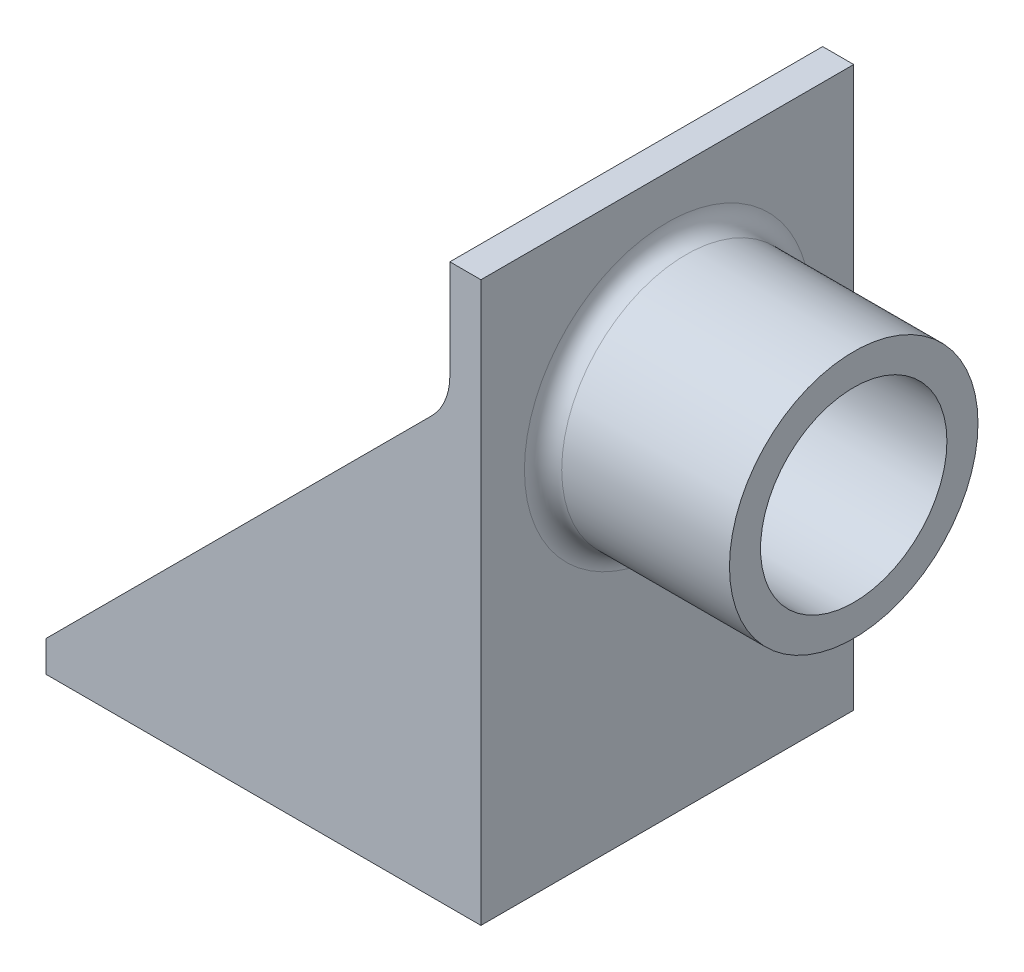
from build123d import *

# Parameters (mm, degrees)
EXTRUDE1_DEPTH = 30
FILLET1_R      = 10
EXTRUDE2_START = -5
EXTRUDE2_DEPTH = 5
FILLET2_R      = 10
SKETCH3_R      = 20
SKETCH3_R_2    = 15
EXTRUDE3_DEPTH = 30
FILLET3_R      = 3


with BuildPart() as part:
    # Sketch1 → Extrude1 (new, symmetric)
    with BuildSketch(Plane.XY):
        Polygon((0, 0), (70, 0), (70, 90), (65, 90), (65, 5), (0, 5), align=None)
    extrude(amount=EXTRUDE1_DEPTH, both=True)

    # Fillet1
    fillet1_edges = [part.edges().sort_by_distance(p)[0] for p in [
        (65, 5, 0),
    ]]
    fillet(fillet1_edges, radius=FILLET1_R)

    # Sketch2 → Extrude2 (add)
    with BuildSketch(Plane.XY.offset(30).offset(EXTRUDE2_START)):
        with BuildLine():
            Line((65, 70), (0, 5))
            Line((0, 5), (55, 5))
            ThreePointArc((55, 5), (62.071067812, 7.928932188), (65, 15))
            Line((65, 15), (65, 70))
        make_face()
    extrude2 = extrude(amount=EXTRUDE2_DEPTH)

    # Mirror1: Extrude2 across plane
    add(extrude2.mirror(Plane.XY))

    # Fillet2
    fillet2_edges = [part.edges().sort_by_distance(p)[0] for p in [
        (65, 70, 27.5),
        (65, 70, -27.5),
    ]]
    fillet(fillet2_edges, radius=FILLET2_R)

    # Sketch3 → Extrude3 (add)
    with BuildSketch(Plane(origin=(70, 0, 0), x_dir=(0, 0, -1), z_dir=(1, 0, 0))):
        with Locations(Location((0, 60, 0), (0, 0, 180))):
            Circle(SKETCH3_R)
        with Locations((0, 60)):
            Circle(SKETCH3_R_2, mode=Mode.SUBTRACT)
    extrude(amount=EXTRUDE3_DEPTH)

    # Fillet3
    fillet3_edges = [part.edges().sort_by_distance(p)[0] for p in [
        (70, 60, -20),
    ]]
    fillet(fillet3_edges, radius=FILLET3_R)


solid = part.part
